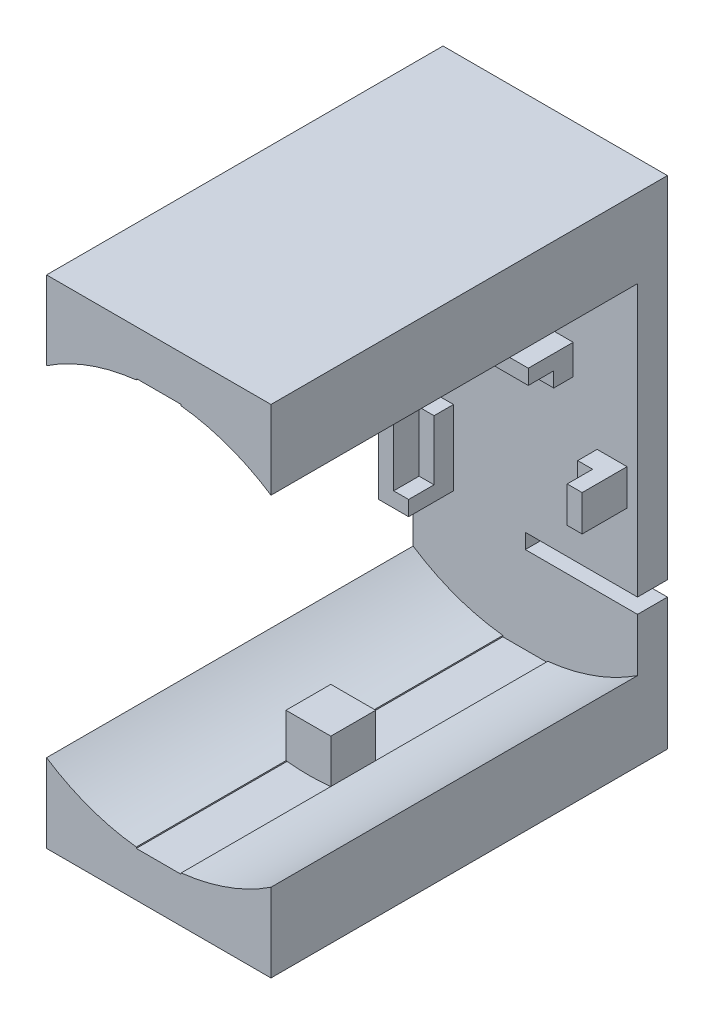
from build123d import *

# Parameters (mm, degrees)
BOSS_EXTRUDE1_DEPTH   = 14.5
BOSS_EXTRUDE1_2_DEPTH = 14.5
BOSS_EXTRUDE1_3_DEPTH = 14.5
BOSS_EXTRUDE1_4_DEPTH = 14.5
SKETCH1_3_W           = 15
SKETCH1_3_H           = 33.2
BOSS_EXTRUDE3_DEPTH   = 2
CUT_EXTRUDE1_DEPTH    = 11.5
BOSS_EXTRUDE4_DEPTH   = 24.5
SKETCH2_W             = 1
SKETCH2_H             = 4
SKETCH2_W_2           = 6.4
SKETCH2_H_2           = 1
SKETCH2_H_3           = 2.4
BOSS_EXTRUDE5_DEPTH   = 1.3
SKETCH2_3_W           = 6.4
SKETCH2_3_H           = 1
SKETCH2_3_W_2         = 1
SKETCH2_3_H_2         = 2.4
BOSS_EXTRUDE6_DEPTH   = 3
SKETCH2_4_W           = 7.5
SKETCH2_4_H           = 1
CUT_EXTRUDE2_DEPTH    = 31.529657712


with BuildPart() as part:
    # Sketch1 → Boss-Extrude1 (new body)
    with BuildSketch(Plane.XY):
        with BuildLine():
            Line((7.5, 16.6), (-7.5, 16.6))
            Line((-7.5, 16.6), (-7.5, 11.34504297))
            ThreePointArc((-7.5, 11.34504297), (-4.629187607, 12.787909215), (-1.5, 13.5170263))
            Line((-1.5, 13.5170263), (-1.5, 13.6))
            Line((-1.5, 13.6), (0, 13.6))
            Line((0, 13.6), (1.5, 13.6))
            Line((1.5, 13.6), (1.5, 13.5170263))
            ThreePointArc((1.5, 13.5170263), (4.629187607, 12.787909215), (7.5, 11.34504297))
            Line((7.5, 11.34504297), (7.5, 16.6))
        make_face()
    extrude(amount=BOSS_EXTRUDE1_DEPTH)



with BuildPart() as body_2:
    # Sketch1 → Boss-Extrude1 2 (new body)
    with BuildSketch(Plane.XY):
        with BuildLine():
            ThreePointArc((0, 13.6), (-0.751146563, 13.579240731), (-1.5, 13.5170263))
            Line((-1.5, 13.5170263), (-1.5, 10.6))
            Line((-1.5, 10.6), (1.5, 10.6))
            Line((1.5, 10.6), (1.5, 13.5170263))
            ThreePointArc((1.5, 13.5170263), (0.751146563, 13.579240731), (0, 13.6))
        make_face()
    extrude(amount=BOSS_EXTRUDE1_2_DEPTH)


with BuildPart() as body_3:
    # Sketch1 → Boss-Extrude1 3 (new body)
    with BuildSketch(Plane.XY):
        with BuildLine():
            Line((-1.5, -10.6), (-1.5, -13.5170263))
            ThreePointArc((-1.5, -13.5170263), (-0.751146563, -13.579240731), (0, -13.6))
            ThreePointArc((0, -13.6), (0.751146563, -13.579240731), (1.5, -13.5170263))
            Line((1.5, -13.5170263), (1.5, -10.6))
            Line((1.5, -10.6), (-1.5, -10.6))
        make_face()
    extrude(amount=BOSS_EXTRUDE1_3_DEPTH)


with BuildPart() as body_4:
    # Sketch1 → Boss-Extrude1 4 (new body)
    with BuildSketch(Plane.XY):
        with BuildLine():
            ThreePointArc((-1.5, -13.5170263), (-4.629187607, -12.787909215), (-7.5, -11.34504297))
            Line((-7.5, -11.34504297), (-7.5, -16.6))
            Line((-7.5, -16.6), (7.5, -16.6))
            Line((7.5, -16.6), (7.5, -11.34504297))
            ThreePointArc((7.5, -11.34504297), (4.629187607, -12.787909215), (1.5, -13.5170263))
            Line((1.5, -13.5170263), (1.5, -13.6))
            Line((1.5, -13.6), (0, -13.6))
            Line((0, -13.6), (-1.5, -13.6))
            Line((-1.5, -13.6), (-1.5, -13.5170263))
        make_face()
    extrude(amount=BOSS_EXTRUDE1_4_DEPTH)


with BuildPart() as part_1:
    add(part.part)

    add(body_4.part)  # Boss-Extrude3 merges body 4
    # Sketch1_3 → Boss-Extrude3 (add)
    with BuildSketch(Plane.XY):
        Rectangle(SKETCH1_3_W, SKETCH1_3_H)
    extrude(amount=-BOSS_EXTRUDE3_DEPTH)

    # Sketch1_5 → Boss-Extrude4 (add)
    with BuildSketch(Plane.XY):
        with BuildLine():
            Line((7.5, 16.6), (-7.5, 16.6))
            Line((-7.5, 16.6), (-7.5, 11.34504297))
            ThreePointArc((-7.5, 11.34504297), (-4.629187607, 12.787909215), (-1.5, 13.5170263))
            Line((-1.5, 13.5170263), (-1.5, 13.6))
            Line((-1.5, 13.6), (0, 13.6))
            Line((0, 13.6), (1.5, 13.6))
            Line((1.5, 13.6), (1.5, 13.5170263))
            ThreePointArc((1.5, 13.5170263), (4.629187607, 12.787909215), (7.5, 11.34504297))
            Line((7.5, 11.34504297), (7.5, 16.6))
        make_face()
        with BuildLine():
            ThreePointArc((-1.5, -13.5170263), (-4.629187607, -12.787909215), (-7.5, -11.34504297))
            Line((-7.5, -11.34504297), (-7.5, -16.6))
            Line((-7.5, -16.6), (7.5, -16.6))
            Line((7.5, -16.6), (7.5, -11.34504297))
            ThreePointArc((7.5, -11.34504297), (4.629187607, -12.787909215), (1.5, -13.5170263))
            Line((1.5, -13.5170263), (1.5, -13.6))
            Line((1.5, -13.6), (0, -13.6))
            Line((0, -13.6), (-1.5, -13.6))
            Line((-1.5, -13.6), (-1.5, -13.5170263))
        make_face()
    extrude(amount=BOSS_EXTRUDE4_DEPTH)

    # Sketch2 → Boss-Extrude5 (add)
    with BuildSketch(Plane.XY):
        with Locations((-5.3, -3.8)):
            Rectangle(SKETCH2_W, SKETCH2_H)
        with Locations((0, 4.3)):
            Rectangle(SKETCH2_W_2, SKETCH2_H_2)
        with Locations((5.3, -0.8)):
            Rectangle(SKETCH2_W, SKETCH2_H_3)
    extrude(amount=BOSS_EXTRUDE5_DEPTH)

    # Sketch2_3 → Boss-Extrude6 (add)
    with BuildSketch(Plane.XY):
        with Locations((0, 5.3)):
            Rectangle(SKETCH2_3_W, SKETCH2_3_H)
        Polygon((-5.8, -1.8), (-6.8, -1.8), (-6.8, -6.8), (-4.8, -6.8), (-4.8, -5.8), (-5.8, -5.8), align=None)
        with Locations((6.3, -0.8)):
            Rectangle(SKETCH2_3_W_2, SKETCH2_3_H_2)
    extrude(amount=BOSS_EXTRUDE6_DEPTH)

    # Sketch2_4 → Cut-Extrude2 (cut, through all)
    with BuildSketch(Plane.XY):
        with Locations((3.75, -7.3)):
            Rectangle(SKETCH2_4_W, SKETCH2_4_H)
    extrude(amount=-CUT_EXTRUDE2_DEPTH, mode=Mode.SUBTRACT)


with BuildPart() as cut_extrude1_tool:
    # Sketch1_4 → Cut-Extrude1 (new body)
    with BuildSketch(Plane.XY):
        with BuildLine():
            Line((-1.5, -10.6), (-1.5, -13.5170263))
            ThreePointArc((-1.5, -13.5170263), (-0.751146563, -13.579240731), (0, -13.6))
            ThreePointArc((0, -13.6), (0.751146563, -13.579240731), (1.5, -13.5170263))
            Line((1.5, -13.5170263), (1.5, -10.6))
            Line((1.5, -10.6), (-1.5, -10.6))
        make_face()
        with BuildLine():
            ThreePointArc((0, 13.6), (-0.751146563, 13.579240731), (-1.5, 13.5170263))
            Line((-1.5, 13.5170263), (-1.5, 10.6))
            Line((-1.5, 10.6), (1.5, 10.6))
            Line((1.5, 10.6), (1.5, 13.5170263))
            ThreePointArc((1.5, 13.5170263), (0.751146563, 13.579240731), (0, 13.6))
        make_face()
    extrude(amount=CUT_EXTRUDE1_DEPTH)


with BuildPart() as body_2_1:
    add(body_2.part)

    # Cut-Extrude1: cut by cut_extrude1_tool
    add(cut_extrude1_tool.part, mode=Mode.SUBTRACT)


with BuildPart() as body_3_1:
    add(body_3.part)

    # Cut-Extrude1: cut by cut_extrude1_tool
    add(cut_extrude1_tool.part, mode=Mode.SUBTRACT)


solid = Compound([part_1.part, body_2_1.part, body_3_1.part])
